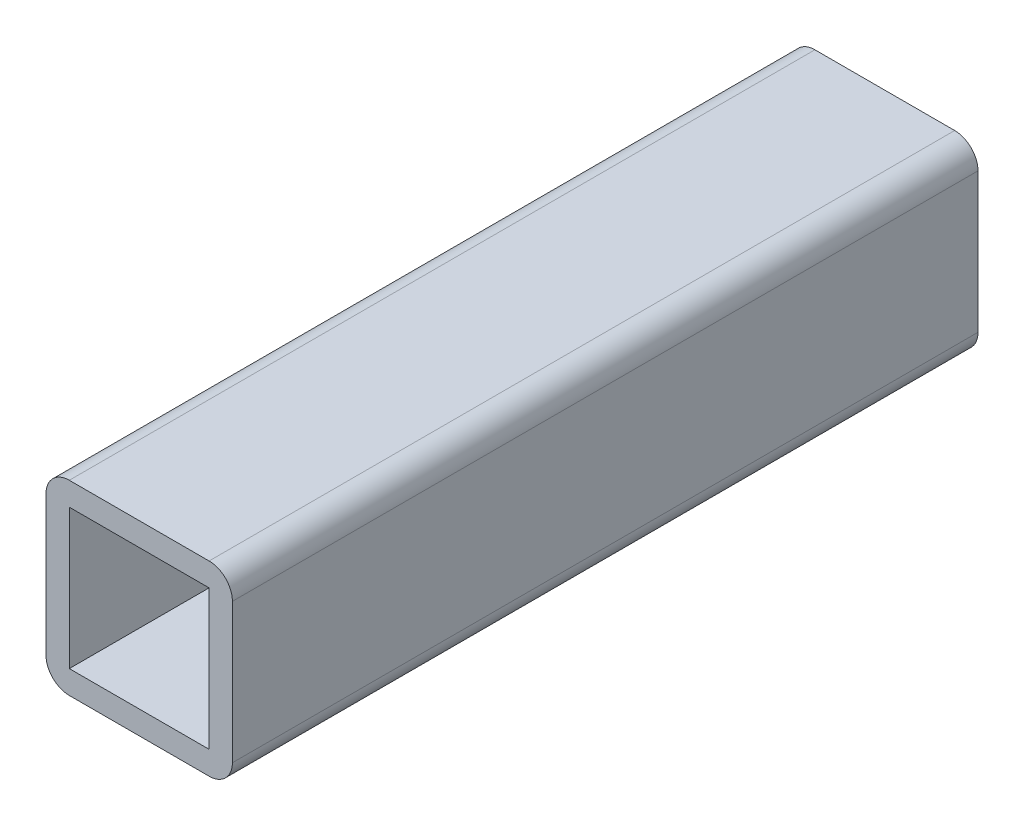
ISO-10303-21;
HEADER;
FILE_DESCRIPTION(('STEP AP214'),'2;1');
FILE_NAME('part.step','',(''),(''),'','','');
FILE_SCHEMA(('AUTOMOTIVE_DESIGN { 1 0 10303 214 1 1 1 1 }'));
ENDSEC;
DATA;
#1=APPLICATION_CONTEXT('core data for automotive mechanical design processes');
#2=APPLICATION_PROTOCOL_DEFINITION('international standard','automotive_design',2000,#1);
#3=PRODUCT_CONTEXT('',#1,'mechanical');
#4=PRODUCT('Part','Part','',(#3));
#5=PRODUCT_RELATED_PRODUCT_CATEGORY('part','',(#4));
#6=PRODUCT_DEFINITION_FORMATION('','',#4);
#7=PRODUCT_DEFINITION_CONTEXT('part definition',#1,'design');
#8=PRODUCT_DEFINITION('design','',#6,#7);
#9=PRODUCT_DEFINITION_SHAPE('','',#8);
#10=(LENGTH_UNIT() NAMED_UNIT(*) SI_UNIT(.MILLI.,.METRE.));
#11=(NAMED_UNIT(*) PLANE_ANGLE_UNIT() SI_UNIT($,.RADIAN.));
#12=(NAMED_UNIT(*) SI_UNIT($,.STERADIAN.) SOLID_ANGLE_UNIT());
#13=UNCERTAINTY_MEASURE_WITH_UNIT(LENGTH_MEASURE(1.E-05),#10,'distance_accuracy_value','');
#14=(GEOMETRIC_REPRESENTATION_CONTEXT(3) GLOBAL_UNCERTAINTY_ASSIGNED_CONTEXT((#13)) GLOBAL_UNIT_ASSIGNED_CONTEXT((#10,
#11,#12)) REPRESENTATION_CONTEXT('',''));
#15=CARTESIAN_POINT('',(0.,0.,0.));
#16=DIRECTION('',(0.,0.,1.));
#17=DIRECTION('',(1.,0.,0.));
#18=AXIS2_PLACEMENT_3D('',#15,#16,#17);
#19=CARTESIAN_POINT('',(-19.0500000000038,-19.050000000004,-203.2));
#20=DIRECTION('',(0.,0.,1.));
#21=DIRECTION('',(1.,0.,0.));
#22=AXIS2_PLACEMENT_3D('',#19,#20,#21);
#23=CYLINDRICAL_SURFACE('',#22,6.35);
#24=CARTESIAN_POINT('',(-19.05,-19.05,0.));
#25=DIRECTION('',(0.,0.,1.));
#26=DIRECTION('',(-1.,0.,0.));
#27=AXIS2_PLACEMENT_3D('',#24,#25,#26);
#28=CIRCLE('',#27,6.35);
#29=CARTESIAN_POINT('',(-25.4000000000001,-19.05,0.));
#30=VERTEX_POINT('',#29);
#31=CARTESIAN_POINT('',(-19.05,-25.4000000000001,0.));
#32=VERTEX_POINT('',#31);
#33=EDGE_CURVE('E164',#30,#32,#28,.T.);
#34=ORIENTED_EDGE('',*,*,#33,.F.);
#35=DIRECTION('',(0.,0.,1.));
#36=VECTOR('',#35,1.);
#37=CARTESIAN_POINT('',(-25.4000000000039,-19.050000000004,-203.2));
#38=LINE('',#37,#36);
#39=CARTESIAN_POINT('',(-25.4000000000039,-19.050000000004,-203.2));
#40=VERTEX_POINT('',#39);
#41=EDGE_CURVE('E13',#40,#30,#38,.T.);
#42=ORIENTED_EDGE('',*,*,#41,.F.);
#43=CARTESIAN_POINT('',(-19.0500000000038,-19.050000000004,-203.2));
#44=DIRECTION('',(0.,0.,1.));
#45=DIRECTION('',(-1.,0.,0.));
#46=AXIS2_PLACEMENT_3D('',#43,#44,#45);
#47=CIRCLE('',#46,6.35);
#48=CARTESIAN_POINT('',(-19.0500000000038,-25.4000000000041,-203.2));
#49=VERTEX_POINT('',#48);
#50=EDGE_CURVE('E168',#40,#49,#47,.T.);
#51=ORIENTED_EDGE('',*,*,#50,.T.);
#52=DIRECTION('',(0.,0.,1.));
#53=VECTOR('',#52,1.);
#54=CARTESIAN_POINT('',(-19.0500000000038,-25.4000000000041,-203.2));
#55=LINE('',#54,#53);
#56=EDGE_CURVE('E45',#49,#32,#55,.T.);
#57=ORIENTED_EDGE('',*,*,#56,.T.);
#58=EDGE_LOOP('',(#34,#42,#51,#57));
#59=FACE_BOUND('',#58,.T.);
#60=ADVANCED_FACE('F42',(#59),#23,.T.);
#61=CARTESIAN_POINT('',(-25.4000000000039,-19.050000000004,-203.2));
#62=DIRECTION('',(-1.,0.,0.));
#63=DIRECTION('',(0.,0.,1.));
#64=AXIS2_PLACEMENT_3D('',#61,#62,#63);
#65=PLANE('',#64);
#66=DIRECTION('',(0.,-1.,0.));
#67=VECTOR('',#66,1.);
#68=CARTESIAN_POINT('',(-25.4000000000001,-19.05,0.));
#69=LINE('',#68,#67);
#70=CARTESIAN_POINT('',(-25.4000000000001,19.05,0.));
#71=VERTEX_POINT('',#70);
#72=EDGE_CURVE('E172',#71,#30,#69,.T.);
#73=ORIENTED_EDGE('',*,*,#72,.F.);
#74=DIRECTION('',(0.,0.,1.));
#75=VECTOR('',#74,1.);
#76=CARTESIAN_POINT('',(-25.4000000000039,19.049999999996,-203.2));
#77=LINE('',#76,#75);
#78=CARTESIAN_POINT('',(-25.4000000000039,19.049999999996,-203.2));
#79=VERTEX_POINT('',#78);
#80=EDGE_CURVE('E50',#79,#71,#77,.T.);
#81=ORIENTED_EDGE('',*,*,#80,.F.);
#82=DIRECTION('',(0.,-1.,0.));
#83=VECTOR('',#82,1.);
#84=CARTESIAN_POINT('',(-25.4000000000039,-19.050000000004,-203.2));
#85=LINE('',#84,#83);
#86=EDGE_CURVE('E190',#79,#40,#85,.T.);
#87=ORIENTED_EDGE('',*,*,#86,.T.);
#88=ORIENTED_EDGE('',*,*,#41,.T.);
#89=EDGE_LOOP('',(#73,#81,#87,#88));
#90=FACE_BOUND('',#89,.T.);
#91=ADVANCED_FACE('F237',(#90),#65,.T.);
#92=CARTESIAN_POINT('',(-19.0500000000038,19.049999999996,-203.2));
#93=DIRECTION('',(0.,0.,1.));
#94=DIRECTION('',(1.,0.,0.));
#95=AXIS2_PLACEMENT_3D('',#92,#93,#94);
#96=CYLINDRICAL_SURFACE('',#95,6.35);
#97=CARTESIAN_POINT('',(-19.05,19.05,0.));
#98=DIRECTION('',(0.,0.,1.));
#99=DIRECTION('',(-1.,0.,0.));
#100=AXIS2_PLACEMENT_3D('',#97,#98,#99);
#101=CIRCLE('',#100,6.35);
#102=CARTESIAN_POINT('',(-19.05,25.4000000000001,0.));
#103=VERTEX_POINT('',#102);
#104=EDGE_CURVE('E210',#103,#71,#101,.T.);
#105=ORIENTED_EDGE('',*,*,#104,.F.);
#106=DIRECTION('',(0.,0.,1.));
#107=VECTOR('',#106,1.);
#108=CARTESIAN_POINT('',(-19.0500000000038,25.3999999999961,-203.2));
#109=LINE('',#108,#107);
#110=CARTESIAN_POINT('',(-19.0500000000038,25.3999999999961,-203.2));
#111=VERTEX_POINT('',#110);
#112=EDGE_CURVE('E216',#111,#103,#109,.T.);
#113=ORIENTED_EDGE('',*,*,#112,.F.);
#114=CARTESIAN_POINT('',(-19.0500000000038,19.049999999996,-203.2));
#115=DIRECTION('',(0.,0.,1.));
#116=DIRECTION('',(-1.,0.,0.));
#117=AXIS2_PLACEMENT_3D('',#114,#115,#116);
#118=CIRCLE('',#117,6.35);
#119=EDGE_CURVE('E187',#111,#79,#118,.T.);
#120=ORIENTED_EDGE('',*,*,#119,.T.);
#121=ORIENTED_EDGE('',*,*,#80,.T.);
#122=EDGE_LOOP('',(#105,#113,#120,#121));
#123=FACE_BOUND('',#122,.T.);
#124=ADVANCED_FACE('F256',(#123),#96,.T.);
#125=CARTESIAN_POINT('',(-19.0500000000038,25.3999999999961,-203.2));
#126=DIRECTION('',(0.,1.,0.));
#127=DIRECTION('',(0.,0.,1.));
#128=AXIS2_PLACEMENT_3D('',#125,#126,#127);
#129=PLANE('',#128);
#130=DIRECTION('',(-1.,0.,0.));
#131=VECTOR('',#130,1.);
#132=CARTESIAN_POINT('',(-19.05,25.4000000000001,0.));
#133=LINE('',#132,#131);
#134=CARTESIAN_POINT('',(19.05,25.4000000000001,0.));
#135=VERTEX_POINT('',#134);
#136=EDGE_CURVE('E207',#135,#103,#133,.T.);
#137=ORIENTED_EDGE('',*,*,#136,.F.);
#138=DIRECTION('',(0.,0.,1.));
#139=VECTOR('',#138,1.);
#140=CARTESIAN_POINT('',(19.049999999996,25.3999999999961,-203.200000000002));
#141=LINE('',#140,#139);
#142=CARTESIAN_POINT('',(19.049999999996,25.3999999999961,-203.200000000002));
#143=VERTEX_POINT('',#142);
#144=EDGE_CURVE('E218',#143,#135,#141,.T.);
#145=ORIENTED_EDGE('',*,*,#144,.F.);
#146=DIRECTION('',(-1.,0.,0.));
#147=VECTOR('',#146,1.);
#148=CARTESIAN_POINT('',(-19.0500000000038,25.3999999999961,-203.2));
#149=LINE('',#148,#147);
#150=EDGE_CURVE('E184',#143,#111,#149,.T.);
#151=ORIENTED_EDGE('',*,*,#150,.T.);
#152=ORIENTED_EDGE('',*,*,#112,.T.);
#153=EDGE_LOOP('',(#137,#145,#151,#152));
#154=FACE_BOUND('',#153,.T.);
#155=ADVANCED_FACE('F254',(#154),#129,.T.);
#156=CARTESIAN_POINT('',(19.049999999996,19.049999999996,-203.200000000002));
#157=DIRECTION('',(0.,0.,1.));
#158=DIRECTION('',(1.,0.,0.));
#159=AXIS2_PLACEMENT_3D('',#156,#157,#158);
#160=CYLINDRICAL_SURFACE('',#159,6.35);
#161=CARTESIAN_POINT('',(19.05,19.05,0.));
#162=DIRECTION('',(0.,0.,1.));
#163=DIRECTION('',(-1.,0.,0.));
#164=AXIS2_PLACEMENT_3D('',#161,#162,#163);
#165=CIRCLE('',#164,6.35);
#166=CARTESIAN_POINT('',(25.4000000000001,19.05,0.));
#167=VERTEX_POINT('',#166);
#168=EDGE_CURVE('E204',#167,#135,#165,.T.);
#169=ORIENTED_EDGE('',*,*,#168,.F.);
#170=DIRECTION('',(0.,0.,1.));
#171=VECTOR('',#170,1.);
#172=CARTESIAN_POINT('',(25.3999999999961,19.049999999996,-203.2));
#173=LINE('',#172,#171);
#174=CARTESIAN_POINT('',(25.3999999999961,19.049999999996,-203.2));
#175=VERTEX_POINT('',#174);
#176=EDGE_CURVE('E220',#175,#167,#173,.T.);
#177=ORIENTED_EDGE('',*,*,#176,.F.);
#178=CARTESIAN_POINT('',(19.049999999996,19.049999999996,-203.200000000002));
#179=DIRECTION('',(0.,0.,1.));
#180=DIRECTION('',(-1.,0.,0.));
#181=AXIS2_PLACEMENT_3D('',#178,#179,#180);
#182=CIRCLE('',#181,6.35);
#183=EDGE_CURVE('E181',#175,#143,#182,.T.);
#184=ORIENTED_EDGE('',*,*,#183,.T.);
#185=ORIENTED_EDGE('',*,*,#144,.T.);
#186=EDGE_LOOP('',(#169,#177,#184,#185));
#187=FACE_BOUND('',#186,.T.);
#188=ADVANCED_FACE('F250',(#187),#160,.T.);
#189=CARTESIAN_POINT('',(25.3999999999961,-19.050000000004,-203.2));
#190=DIRECTION('',(1.,0.,0.));
#191=DIRECTION('',(0.,0.,-1.));
#192=AXIS2_PLACEMENT_3D('',#189,#190,#191);
#193=PLANE('',#192);
#194=DIRECTION('',(0.,1.,0.));
#195=VECTOR('',#194,1.);
#196=CARTESIAN_POINT('',(25.4000000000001,-19.05,0.));
#197=LINE('',#196,#195);
#198=CARTESIAN_POINT('',(25.4000000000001,-19.05,0.));
#199=VERTEX_POINT('',#198);
#200=EDGE_CURVE('E201',#199,#167,#197,.T.);
#201=ORIENTED_EDGE('',*,*,#200,.F.);
#202=DIRECTION('',(0.,0.,1.));
#203=VECTOR('',#202,1.);
#204=CARTESIAN_POINT('',(25.3999999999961,-19.050000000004,-203.2));
#205=LINE('',#204,#203);
#206=CARTESIAN_POINT('',(25.3999999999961,-19.050000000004,-203.2));
#207=VERTEX_POINT('',#206);
#208=EDGE_CURVE('E222',#207,#199,#205,.T.);
#209=ORIENTED_EDGE('',*,*,#208,.F.);
#210=DIRECTION('',(0.,1.,0.));
#211=VECTOR('',#210,1.);
#212=CARTESIAN_POINT('',(25.3999999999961,-19.050000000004,-203.2));
#213=LINE('',#212,#211);
#214=EDGE_CURVE('E178',#207,#175,#213,.T.);
#215=ORIENTED_EDGE('',*,*,#214,.T.);
#216=ORIENTED_EDGE('',*,*,#176,.T.);
#217=EDGE_LOOP('',(#201,#209,#215,#216));
#218=FACE_BOUND('',#217,.T.);
#219=ADVANCED_FACE('F248',(#218),#193,.T.);
#220=CARTESIAN_POINT('',(19.049999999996,-19.050000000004,-203.2));
#221=DIRECTION('',(0.,0.,1.));
#222=DIRECTION('',(1.,0.,0.));
#223=AXIS2_PLACEMENT_3D('',#220,#221,#222);
#224=CYLINDRICAL_SURFACE('',#223,6.35);
#225=CARTESIAN_POINT('',(19.05,-19.05,0.));
#226=DIRECTION('',(0.,0.,1.));
#227=DIRECTION('',(1.,0.,0.));
#228=AXIS2_PLACEMENT_3D('',#225,#226,#227);
#229=CIRCLE('',#228,6.35);
#230=CARTESIAN_POINT('',(19.05,-25.4000000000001,0.));
#231=VERTEX_POINT('',#230);
#232=EDGE_CURVE('E198',#231,#199,#229,.T.);
#233=ORIENTED_EDGE('',*,*,#232,.F.);
#234=DIRECTION('',(0.,0.,1.));
#235=VECTOR('',#234,1.);
#236=CARTESIAN_POINT('',(19.049999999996,-25.4000000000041,-203.2));
#237=LINE('',#236,#235);
#238=CARTESIAN_POINT('',(19.049999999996,-25.4000000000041,-203.2));
#239=VERTEX_POINT('',#238);
#240=EDGE_CURVE('E223',#239,#231,#237,.T.);
#241=ORIENTED_EDGE('',*,*,#240,.F.);
#242=CARTESIAN_POINT('',(19.049999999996,-19.050000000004,-203.2));
#243=DIRECTION('',(0.,0.,1.));
#244=DIRECTION('',(1.,0.,0.));
#245=AXIS2_PLACEMENT_3D('',#242,#243,#244);
#246=CIRCLE('',#245,6.35);
#247=EDGE_CURVE('E175',#239,#207,#246,.T.);
#248=ORIENTED_EDGE('',*,*,#247,.T.);
#249=ORIENTED_EDGE('',*,*,#208,.T.);
#250=EDGE_LOOP('',(#233,#241,#248,#249));
#251=FACE_BOUND('',#250,.T.);
#252=ADVANCED_FACE('F244',(#251),#224,.T.);
#253=CARTESIAN_POINT('',(-19.0500000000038,-25.4000000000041,-203.2));
#254=DIRECTION('',(0.,-1.,0.));
#255=DIRECTION('',(0.,0.,-1.));
#256=AXIS2_PLACEMENT_3D('',#253,#254,#255);
#257=PLANE('',#256);
#258=DIRECTION('',(1.,0.,0.));
#259=VECTOR('',#258,1.);
#260=CARTESIAN_POINT('',(-19.05,-25.4000000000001,0.));
#261=LINE('',#260,#259);
#262=EDGE_CURVE('E195',#32,#231,#261,.T.);
#263=ORIENTED_EDGE('',*,*,#262,.F.);
#264=ORIENTED_EDGE('',*,*,#56,.F.);
#265=DIRECTION('',(1.,0.,0.));
#266=VECTOR('',#265,1.);
#267=CARTESIAN_POINT('',(-19.0500000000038,-25.4000000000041,-203.2));
#268=LINE('',#267,#266);
#269=EDGE_CURVE('E171',#49,#239,#268,.T.);
#270=ORIENTED_EDGE('',*,*,#269,.T.);
#271=ORIENTED_EDGE('',*,*,#240,.T.);
#272=EDGE_LOOP('',(#263,#264,#270,#271));
#273=FACE_BOUND('',#272,.T.);
#274=ADVANCED_FACE('F231',(#273),#257,.T.);
#275=CARTESIAN_POINT('',(-19.0500000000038,-19.050000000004,-203.2));
#276=DIRECTION('',(0.,0.,-1.));
#277=DIRECTION('',(-1.,0.,0.));
#278=AXIS2_PLACEMENT_3D('',#275,#276,#277);
#279=PLANE('',#278);
#280=DIRECTION('',(1.,0.,0.));
#281=VECTOR('',#280,1.);
#282=CARTESIAN_POINT('',(-19.0500000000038,-19.050000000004,-203.2));
#283=LINE('',#282,#281);
#284=CARTESIAN_POINT('',(-19.0500000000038,-19.050000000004,-203.2));
#285=VERTEX_POINT('',#284);
#286=CARTESIAN_POINT('',(19.049999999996,-19.050000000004,-203.2));
#287=VERTEX_POINT('',#286);
#288=EDGE_CURVE('E133',#285,#287,#283,.T.);
#289=ORIENTED_EDGE('',*,*,#288,.T.);
#290=DIRECTION('',(0.,1.,0.));
#291=VECTOR('',#290,1.);
#292=CARTESIAN_POINT('',(19.049999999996,-19.050000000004,-203.2));
#293=LINE('',#292,#291);
#294=CARTESIAN_POINT('',(19.049999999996,19.049999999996,-203.200000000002));
#295=VERTEX_POINT('',#294);
#296=EDGE_CURVE('E142',#287,#295,#293,.T.);
#297=ORIENTED_EDGE('',*,*,#296,.T.);
#298=DIRECTION('',(-1.,0.,0.));
#299=VECTOR('',#298,1.);
#300=CARTESIAN_POINT('',(-19.0500000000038,19.049999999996,-203.2));
#301=LINE('',#300,#299);
#302=CARTESIAN_POINT('',(-19.0500000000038,19.049999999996,-203.2));
#303=VERTEX_POINT('',#302);
#304=EDGE_CURVE('E58',#295,#303,#301,.T.);
#305=ORIENTED_EDGE('',*,*,#304,.T.);
#306=DIRECTION('',(0.,-1.,0.));
#307=VECTOR('',#306,1.);
#308=CARTESIAN_POINT('',(-19.0500000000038,-19.050000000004,-203.2));
#309=LINE('',#308,#307);
#310=EDGE_CURVE('E139',#303,#285,#309,.T.);
#311=ORIENTED_EDGE('',*,*,#310,.T.);
#312=EDGE_LOOP('',(#289,#297,#305,#311));
#313=FACE_BOUND('',#312,.T.);
#314=ORIENTED_EDGE('',*,*,#50,.F.);
#315=ORIENTED_EDGE('',*,*,#86,.F.);
#316=ORIENTED_EDGE('',*,*,#119,.F.);
#317=ORIENTED_EDGE('',*,*,#150,.F.);
#318=ORIENTED_EDGE('',*,*,#183,.F.);
#319=ORIENTED_EDGE('',*,*,#214,.F.);
#320=ORIENTED_EDGE('',*,*,#247,.F.);
#321=ORIENTED_EDGE('',*,*,#269,.F.);
#322=EDGE_LOOP('',(#314,#315,#316,#317,#318,#319,#320,#321));
#323=FACE_BOUND('',#322,.T.);
#324=ADVANCED_FACE('F146',(#313,#323),#279,.T.);
#325=CARTESIAN_POINT('',(-19.05,-19.05,0.));
#326=DIRECTION('',(0.,0.,-1.));
#327=DIRECTION('',(-1.,0.,0.));
#328=AXIS2_PLACEMENT_3D('',#325,#326,#327);
#329=PLANE('',#328);
#330=DIRECTION('',(0.,1.,0.));
#331=VECTOR('',#330,1.);
#332=CARTESIAN_POINT('',(19.05,-19.05,0.));
#333=LINE('',#332,#331);
#334=CARTESIAN_POINT('',(19.05,-19.05,0.));
#335=VERTEX_POINT('',#334);
#336=CARTESIAN_POINT('',(19.05,19.05,0.));
#337=VERTEX_POINT('',#336);
#338=EDGE_CURVE('E158',#335,#337,#333,.T.);
#339=ORIENTED_EDGE('',*,*,#338,.F.);
#340=DIRECTION('',(1.,0.,0.));
#341=VECTOR('',#340,1.);
#342=CARTESIAN_POINT('',(-19.05,-19.05,0.));
#343=LINE('',#342,#341);
#344=CARTESIAN_POINT('',(-19.05,-19.05,0.));
#345=VERTEX_POINT('',#344);
#346=EDGE_CURVE('E66',#345,#335,#343,.T.);
#347=ORIENTED_EDGE('',*,*,#346,.F.);
#348=DIRECTION('',(0.,-1.,0.));
#349=VECTOR('',#348,1.);
#350=CARTESIAN_POINT('',(-19.05,-19.05,0.));
#351=LINE('',#350,#349);
#352=CARTESIAN_POINT('',(-19.05,19.05,0.));
#353=VERTEX_POINT('',#352);
#354=EDGE_CURVE('E149',#353,#345,#351,.T.);
#355=ORIENTED_EDGE('',*,*,#354,.F.);
#356=DIRECTION('',(-1.,0.,0.));
#357=VECTOR('',#356,1.);
#358=CARTESIAN_POINT('',(-19.05,19.05,0.));
#359=LINE('',#358,#357);
#360=EDGE_CURVE('E152',#337,#353,#359,.T.);
#361=ORIENTED_EDGE('',*,*,#360,.F.);
#362=EDGE_LOOP('',(#339,#347,#355,#361));
#363=FACE_BOUND('',#362,.T.);
#364=ORIENTED_EDGE('',*,*,#33,.T.);
#365=ORIENTED_EDGE('',*,*,#262,.T.);
#366=ORIENTED_EDGE('',*,*,#232,.T.);
#367=ORIENTED_EDGE('',*,*,#200,.T.);
#368=ORIENTED_EDGE('',*,*,#168,.T.);
#369=ORIENTED_EDGE('',*,*,#136,.T.);
#370=ORIENTED_EDGE('',*,*,#104,.T.);
#371=ORIENTED_EDGE('',*,*,#72,.T.);
#372=EDGE_LOOP('',(#364,#365,#366,#367,#368,#369,#370,#371));
#373=FACE_BOUND('',#372,.T.);
#374=ADVANCED_FACE('F233',(#363,#373),#329,.F.);
#375=CARTESIAN_POINT('',(-19.0500000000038,-19.050000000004,-203.2));
#376=DIRECTION('',(0.,-1.,0.));
#377=DIRECTION('',(0.,0.,-1.));
#378=AXIS2_PLACEMENT_3D('',#375,#376,#377);
#379=PLANE('',#378);
#380=ORIENTED_EDGE('',*,*,#346,.T.);
#381=DIRECTION('',(0.,0.,1.));
#382=VECTOR('',#381,1.);
#383=CARTESIAN_POINT('',(19.049999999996,-19.050000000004,-203.2));
#384=LINE('',#383,#382);
#385=EDGE_CURVE('E129',#287,#335,#384,.T.);
#386=ORIENTED_EDGE('',*,*,#385,.F.);
#387=ORIENTED_EDGE('',*,*,#288,.F.);
#388=DIRECTION('',(0.,0.,1.));
#389=VECTOR('',#388,1.);
#390=CARTESIAN_POINT('',(-19.0500000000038,-19.050000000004,-203.2));
#391=LINE('',#390,#389);
#392=EDGE_CURVE('E162',#285,#345,#391,.T.);
#393=ORIENTED_EDGE('',*,*,#392,.T.);
#394=EDGE_LOOP('',(#380,#386,#387,#393));
#395=FACE_BOUND('',#394,.T.);
#396=ADVANCED_FACE('F131',(#395),#379,.F.);
#397=CARTESIAN_POINT('',(-19.0500000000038,-19.050000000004,-203.2));
#398=DIRECTION('',(-1.,0.,0.));
#399=DIRECTION('',(0.,0.,1.));
#400=AXIS2_PLACEMENT_3D('',#397,#398,#399);
#401=PLANE('',#400);
#402=ORIENTED_EDGE('',*,*,#354,.T.);
#403=ORIENTED_EDGE('',*,*,#392,.F.);
#404=ORIENTED_EDGE('',*,*,#310,.F.);
#405=DIRECTION('',(0.,0.,1.));
#406=VECTOR('',#405,1.);
#407=CARTESIAN_POINT('',(-19.0500000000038,19.049999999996,-203.2));
#408=LINE('',#407,#406);
#409=EDGE_CURVE('E165',#303,#353,#408,.T.);
#410=ORIENTED_EDGE('',*,*,#409,.T.);
#411=EDGE_LOOP('',(#402,#403,#404,#410));
#412=FACE_BOUND('',#411,.T.);
#413=ADVANCED_FACE('F339',(#412),#401,.F.);
#414=CARTESIAN_POINT('',(-19.0500000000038,19.049999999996,-203.2));
#415=DIRECTION('',(0.,1.,0.));
#416=DIRECTION('',(-1.,0.,0.));
#417=AXIS2_PLACEMENT_3D('',#414,#415,#416);
#418=PLANE('',#417);
#419=ORIENTED_EDGE('',*,*,#360,.T.);
#420=ORIENTED_EDGE('',*,*,#409,.F.);
#421=ORIENTED_EDGE('',*,*,#304,.F.);
#422=DIRECTION('',(0.,0.,1.));
#423=VECTOR('',#422,1.);
#424=CARTESIAN_POINT('',(19.049999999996,19.049999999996,-203.200000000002));
#425=LINE('',#424,#423);
#426=EDGE_CURVE('E138',#295,#337,#425,.T.);
#427=ORIENTED_EDGE('',*,*,#426,.T.);
#428=EDGE_LOOP('',(#419,#420,#421,#427));
#429=FACE_BOUND('',#428,.T.);
#430=ADVANCED_FACE('F348',(#429),#418,.F.);
#431=CARTESIAN_POINT('',(19.049999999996,-19.050000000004,-203.2));
#432=DIRECTION('',(1.,0.,0.));
#433=DIRECTION('',(0.,1.,0.));
#434=AXIS2_PLACEMENT_3D('',#431,#432,#433);
#435=PLANE('',#434);
#436=ORIENTED_EDGE('',*,*,#338,.T.);
#437=ORIENTED_EDGE('',*,*,#426,.F.);
#438=ORIENTED_EDGE('',*,*,#296,.F.);
#439=ORIENTED_EDGE('',*,*,#385,.T.);
#440=EDGE_LOOP('',(#436,#437,#438,#439));
#441=FACE_BOUND('',#440,.T.);
#442=ADVANCED_FACE('F143',(#441),#435,.F.);
#443=CLOSED_SHELL('',(#60,#91,#124,#155,#188,#219,#252,#274,#324,#374,#396,#413,#430,#442));
#444=MANIFOLD_SOLID_BREP('B2',#443);
#445=ADVANCED_BREP_SHAPE_REPRESENTATION('',(#18,#444),#14);
#446=SHAPE_DEFINITION_REPRESENTATION(#9,#445);
ENDSEC;
END-ISO-10303-21;
